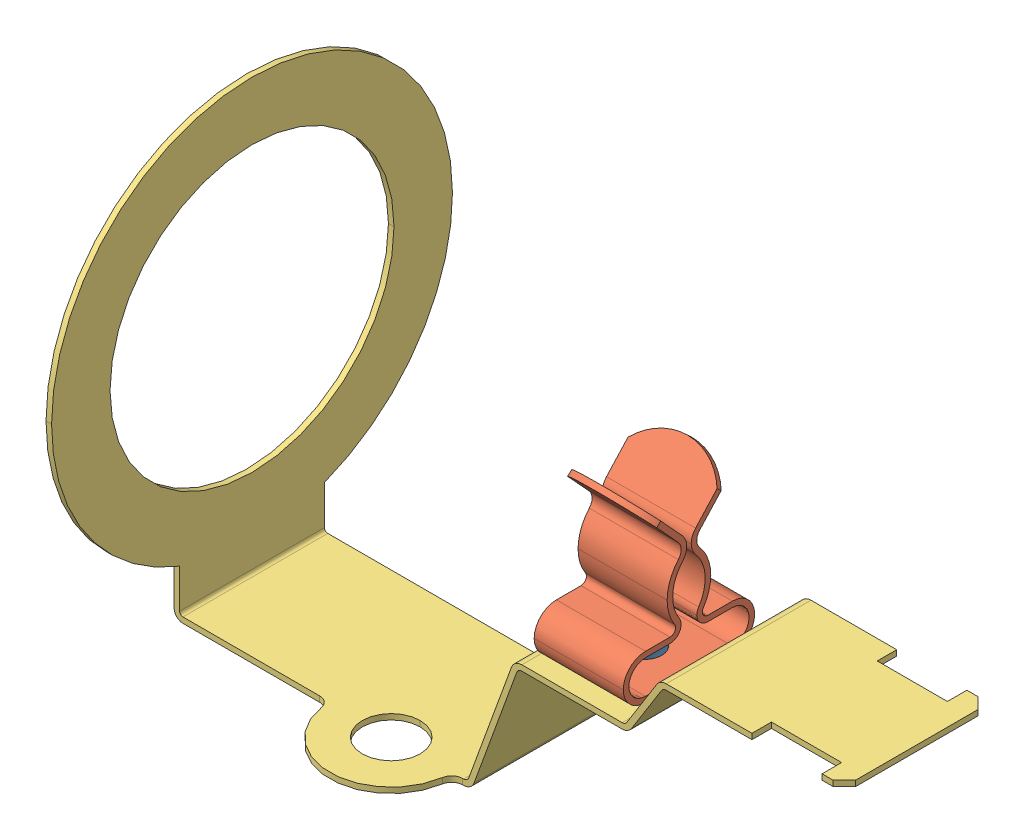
SolidWorks assembly 37180_2.SLDASM, configuration Default (file format 8000). Lengths in mm.
Overall size (60.19 39.09 36).
3 component instances, 3 part files, 0 mates.
Components (placement in the parent):
- 37180_2_01-1: 37180_2_01.SLDPRT [Default] at origin size (6 4.5 6)
- 37180_2_02-1: 37180_2_02.SLDPRT [Default] at origin size (8 14.92 11.8)
- 37180_2_03-1: 37180_2_03.SLDPRT [Default] at origin size (60.19 39.09 36)
